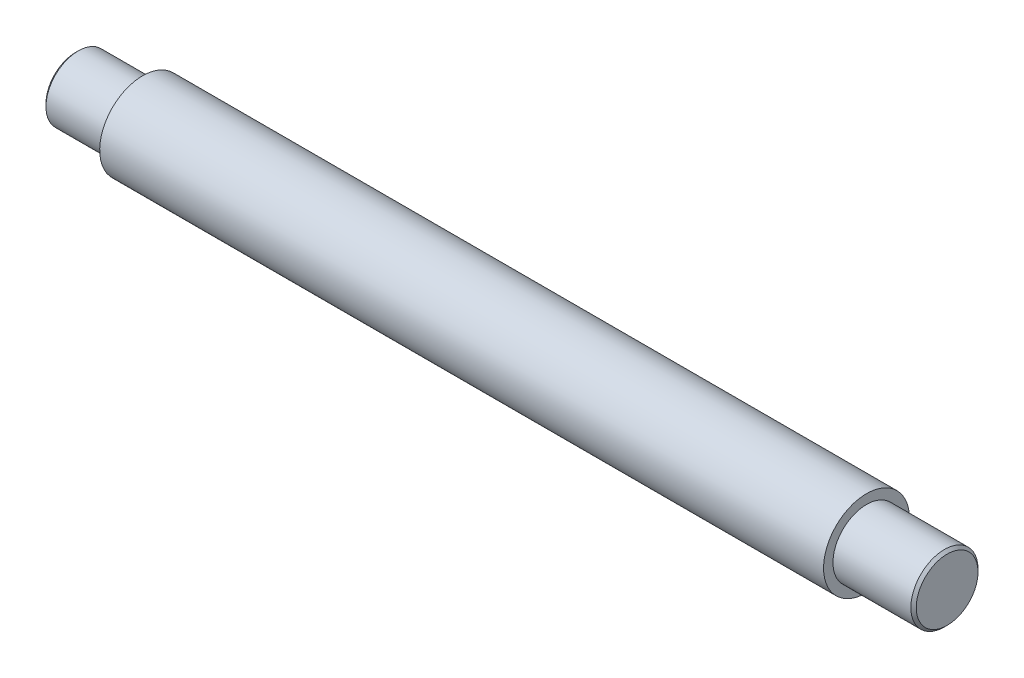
ISO-10303-21;
HEADER;
FILE_DESCRIPTION(('STEP AP214'),'2;1');
FILE_NAME('part.step','',(''),(''),'','','');
FILE_SCHEMA(('AUTOMOTIVE_DESIGN { 1 0 10303 214 1 1 1 1 }'));
ENDSEC;
DATA;
#1=APPLICATION_CONTEXT('core data for automotive mechanical design processes');
#2=APPLICATION_PROTOCOL_DEFINITION('international standard','automotive_design',2000,#1);
#3=PRODUCT_CONTEXT('',#1,'mechanical');
#4=PRODUCT('Part','Part','',(#3));
#5=PRODUCT_RELATED_PRODUCT_CATEGORY('part','',(#4));
#6=PRODUCT_DEFINITION_FORMATION('','',#4);
#7=PRODUCT_DEFINITION_CONTEXT('part definition',#1,'design');
#8=PRODUCT_DEFINITION('design','',#6,#7);
#9=PRODUCT_DEFINITION_SHAPE('','',#8);
#10=(LENGTH_UNIT() NAMED_UNIT(*) SI_UNIT(.MILLI.,.METRE.));
#11=(NAMED_UNIT(*) PLANE_ANGLE_UNIT() SI_UNIT($,.RADIAN.));
#12=(NAMED_UNIT(*) SI_UNIT($,.STERADIAN.) SOLID_ANGLE_UNIT());
#13=UNCERTAINTY_MEASURE_WITH_UNIT(LENGTH_MEASURE(1.E-05),#10,'distance_accuracy_value','');
#14=(GEOMETRIC_REPRESENTATION_CONTEXT(3) GLOBAL_UNCERTAINTY_ASSIGNED_CONTEXT((#13)) GLOBAL_UNIT_ASSIGNED_CONTEXT((#10,
#11,#12)) REPRESENTATION_CONTEXT('',''));
#15=CARTESIAN_POINT('',(0.,0.,0.));
#16=DIRECTION('',(0.,0.,1.));
#17=DIRECTION('',(1.,0.,0.));
#18=AXIS2_PLACEMENT_3D('',#15,#16,#17);
#19=CARTESIAN_POINT('',(311.461782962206,436.896737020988,97.0115114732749));
#20=DIRECTION('',(-1.,0.,0.));
#21=DIRECTION('',(0.,-1.,0.));
#22=AXIS2_PLACEMENT_3D('',#19,#20,#21);
#23=PLANE('',#22);
#24=CARTESIAN_POINT('',(311.461782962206,433.486383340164,86.0288211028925));
#25=DIRECTION('',(-1.,0.,0.));
#26=DIRECTION('',(0.,-1.,0.));
#27=AXIS2_PLACEMENT_3D('',#24,#25,#26);
#28=CIRCLE('',#27,11.5);
#29=CARTESIAN_POINT('',(311.461782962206,421.986383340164,86.0288211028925));
#30=VERTEX_POINT('',#29);
#31=EDGE_CURVE('E204',#30,#30,#28,.T.);
#32=ORIENTED_EDGE('',*,*,#31,.F.);
#33=EDGE_LOOP('',(#32));
#34=FACE_BOUND('',#33,.T.);
#35=ADVANCED_FACE('F32',(#34),#23,.F.);
#36=CARTESIAN_POINT('',(311.461782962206,433.486383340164,86.0288211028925));
#37=DIRECTION('',(-1.,0.,0.));
#38=DIRECTION('',(0.,-1.,0.));
#39=AXIS2_PLACEMENT_3D('',#36,#37,#38);
#40=CONICAL_SURFACE('',#39,11.5,0.785398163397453);
#41=CARTESIAN_POINT('',(310.461782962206,433.486383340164,86.0288211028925));
#42=DIRECTION('',(-1.,0.,0.));
#43=DIRECTION('',(0.,-1.,0.));
#44=AXIS2_PLACEMENT_3D('',#41,#42,#43);
#45=CIRCLE('',#44,12.5);
#46=CARTESIAN_POINT('',(310.461782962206,420.986383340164,86.0288211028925));
#47=VERTEX_POINT('',#46);
#48=EDGE_CURVE('E201',#47,#47,#45,.T.);
#49=ORIENTED_EDGE('',*,*,#48,.F.);
#50=EDGE_LOOP('',(#49));
#51=FACE_BOUND('',#50,.T.);
#52=ORIENTED_EDGE('',*,*,#31,.T.);
#53=EDGE_LOOP('',(#52));
#54=FACE_BOUND('',#53,.T.);
#55=ADVANCED_FACE('F323',(#51,#54),#40,.T.);
#56=CARTESIAN_POINT('',(-27.883598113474,433.486383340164,86.0288211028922));
#57=DIRECTION('',(-1.,0.,0.));
#58=DIRECTION('',(0.,-1.,0.));
#59=AXIS2_PLACEMENT_3D('',#56,#57,#58);
#60=CYLINDRICAL_SURFACE('',#59,12.5);
#61=DIRECTION('',(-1.,0.,0.));
#62=VECTOR('',#61,1.);
#63=CARTESIAN_POINT('',(-27.883598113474,436.216039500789,73.8305024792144));
#64=LINE('',#63,#62);
#65=CARTESIAN_POINT('',(287.461782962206,436.216039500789,73.8305024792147));
#66=VERTEX_POINT('',#65);
#67=CARTESIAN_POINT('',(305.461782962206,436.216039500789,73.8305024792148));
#68=VERTEX_POINT('',#67);
#69=EDGE_CURVE('E291',#66,#68,#64,.F.);
#70=ORIENTED_EDGE('',*,*,#69,.T.);
#71=CARTESIAN_POINT('',(305.461782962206,436.216039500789,73.8305024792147));
#72=CARTESIAN_POINT('',(305.544859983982,436.216027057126,73.8305061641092));
#73=CARTESIAN_POINT('',(305.627931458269,436.219508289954,73.831278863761));
#74=CARTESIAN_POINT('',(305.793455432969,436.233362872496,73.8343881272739));
#75=CARTESIAN_POINT('',(305.875908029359,436.243735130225,73.8367244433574));
#76=CARTESIAN_POINT('',(306.03945947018,436.271250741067,73.8429808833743));
#77=CARTESIAN_POINT('',(306.120560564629,436.288381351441,73.8468980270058));
#78=CARTESIAN_POINT('',(306.280971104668,436.329215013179,73.8563626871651));
#79=CARTESIAN_POINT('',(306.360280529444,436.352918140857,73.8619102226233));
#80=CARTESIAN_POINT('',(306.594684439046,436.433554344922,73.881093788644));
#81=CARTESIAN_POINT('',(306.746411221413,436.500041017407,73.8972764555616));
#82=CARTESIAN_POINT('',(307.036478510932,436.65587803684,73.9370582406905));
#83=CARTESIAN_POINT('',(307.174815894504,436.745233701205,73.9606590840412));
#84=CARTESIAN_POINT('',(307.43704018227,436.945515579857,74.0165198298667));
#85=CARTESIAN_POINT('',(307.56061952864,437.056803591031,74.0489290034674));
#86=CARTESIAN_POINT('',(307.787092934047,437.296157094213,74.1228860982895));
#87=CARTESIAN_POINT('',(307.889983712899,437.424225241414,74.1644354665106));
#88=CARTESIAN_POINT('',(308.07341122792,437.694774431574,74.2576637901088));
#89=CARTESIAN_POINT('',(308.153645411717,437.837418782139,74.3094654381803));
#90=CARTESIAN_POINT('',(308.287512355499,438.131100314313,74.4227306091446));
#91=CARTESIAN_POINT('',(308.341150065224,438.282135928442,74.484192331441));
#92=CARTESIAN_POINT('',(308.419320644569,438.584874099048,74.61470516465));
#93=CARTESIAN_POINT('',(308.444379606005,438.736511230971,74.6835926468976));
#94=CARTESIAN_POINT('',(308.466330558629,439.038509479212,74.8282892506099));
#95=CARTESIAN_POINT('',(308.463225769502,439.188870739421,74.9040975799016));
#96=CARTESIAN_POINT('',(308.429319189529,439.480850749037,75.0587203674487));
#97=CARTESIAN_POINT('',(308.399085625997,439.622585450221,75.1374415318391));
#98=CARTESIAN_POINT('',(308.312690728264,439.896883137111,75.2965961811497));
#99=CARTESIAN_POINT('',(308.256528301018,440.029445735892,75.3770297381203));
#100=CARTESIAN_POINT('',(308.11939530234,440.283389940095,75.5372314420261));
#101=CARTESIAN_POINT('',(308.03821781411,440.404666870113,75.6169881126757));
#102=CARTESIAN_POINT('',(307.853516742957,440.632254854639,75.7718480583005));
#103=CARTESIAN_POINT('',(307.749990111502,440.738563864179,75.8469506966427));
#104=CARTESIAN_POINT('',(307.520481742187,440.936674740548,75.9909652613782));
#105=CARTESIAN_POINT('',(307.394005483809,441.028049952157,76.0596767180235));
#106=CARTESIAN_POINT('',(307.123738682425,441.191330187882,76.1853236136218));
#107=CARTESIAN_POINT('',(306.979943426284,441.263229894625,76.2422558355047));
#108=CARTESIAN_POINT('',(306.678227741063,441.386461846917,76.3414545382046));
#109=CARTESIAN_POINT('',(306.520244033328,441.437695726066,76.3836507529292));
#110=CARTESIAN_POINT('',(306.19529881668,441.517998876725,76.4504117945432));
#111=CARTESIAN_POINT('',(306.028351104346,441.547101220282,76.4750029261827));
#112=CARTESIAN_POINT('',(305.793614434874,441.57178276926,76.4959112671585));
#113=CARTESIAN_POINT('',(305.72737602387,441.576983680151,76.500326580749));
#114=CARTESIAN_POINT('',(305.594696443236,441.583910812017,76.5062128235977));
#115=CARTESIAN_POINT('',(305.528255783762,441.585642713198,76.5076885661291));
#116=CARTESIAN_POINT('',(305.461782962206,441.585645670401,76.5076893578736));
#117=B_SPLINE_CURVE_WITH_KNOTS('',3,(#71,#72,#73,#74,#75,#76,#77,#78,#79,#80,#81,#82,#83,#84,
#85,#86,#87,#88,#89,#90,#91,#92,#93,#94,#95,#96,#97,#98,#99,#100,#101,#102,#103,#104,#105,#106,
#107,#108,#109,#110,#111,#112,#113,#114,#115,#116),.UNSPECIFIED.,.F.,.F.,(4,2,2,2,2,2,2,2,2,2,2,
2,2,2,2,2,2,2,2,2,2,2,4),(0.,0.24914497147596,0.498250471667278,0.746888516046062,
0.995529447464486,1.49234020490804,1.9892665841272,2.49520478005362,3.00122312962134,
3.51370966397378,4.02610078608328,4.52889907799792,5.03163989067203,5.5240901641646,
6.01656119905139,6.51322041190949,7.00994741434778,7.51903074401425,8.028252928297,
8.5398711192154,9.05072326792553,9.25036600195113,9.44968157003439),.UNSPECIFIED.);
#118=CARTESIAN_POINT('',(305.461782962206,441.585645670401,76.5076893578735));
#119=VERTEX_POINT('',#118);
#120=EDGE_CURVE('E308',#68,#119,#117,.T.);
#121=ORIENTED_EDGE('',*,*,#120,.T.);
#122=DIRECTION('',(-1.,0.,0.));
#123=VECTOR('',#122,1.);
#124=CARTESIAN_POINT('',(-27.883598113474,441.585645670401,76.5076893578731));
#125=LINE('',#124,#123);
#126=CARTESIAN_POINT('',(287.461782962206,441.585645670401,76.5076893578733));
#127=VERTEX_POINT('',#126);
#128=EDGE_CURVE('E124',#119,#127,#125,.T.);
#129=ORIENTED_EDGE('',*,*,#128,.T.);
#130=CARTESIAN_POINT('',(287.461782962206,441.585645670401,76.5076893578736));
#131=CARTESIAN_POINT('',(287.37870594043,441.585650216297,76.5077015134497));
#132=CARTESIAN_POINT('',(287.295634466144,441.582938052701,76.5053862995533));
#133=CARTESIAN_POINT('',(287.130110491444,441.572116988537,76.4961927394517));
#134=CARTESIAN_POINT('',(287.047657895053,441.564008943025,76.4893151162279));
#135=CARTESIAN_POINT('',(286.884106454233,441.542453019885,76.4711053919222));
#136=CARTESIAN_POINT('',(286.803005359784,441.529015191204,76.459781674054));
#137=CARTESIAN_POINT('',(286.642594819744,441.496882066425,76.4328664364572));
#138=CARTESIAN_POINT('',(286.563285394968,441.478186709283,76.417274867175));
#139=CARTESIAN_POINT('',(286.328881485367,441.414337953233,76.3644208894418));
#140=CARTESIAN_POINT('',(286.177154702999,441.361401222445,76.3210612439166));
#141=CARTESIAN_POINT('',(285.887087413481,441.23584501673,76.2205455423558));
#142=CARTESIAN_POINT('',(285.748750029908,441.163220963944,76.1633862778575));
#143=CARTESIAN_POINT('',(285.486525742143,440.998075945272,76.037051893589));
#144=CARTESIAN_POINT('',(285.362946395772,440.905218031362,75.967677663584));
#145=CARTESIAN_POINT('',(285.136472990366,440.702106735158,75.8210299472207));
#146=CARTESIAN_POINT('',(285.033582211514,440.591850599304,75.743755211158));
#147=CARTESIAN_POINT('',(284.850154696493,440.354574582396,75.5837912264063));
#148=CARTESIAN_POINT('',(284.769920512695,440.22735843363,75.5010453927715));
#149=CARTESIAN_POINT('',(284.636053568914,439.960158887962,75.3346655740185));
#150=CARTESIAN_POINT('',(284.582415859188,439.820177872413,75.2510317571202));
#151=CARTESIAN_POINT('',(284.504245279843,439.533753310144,75.0877988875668));
#152=CARTESIAN_POINT('',(284.479186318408,439.387479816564,75.0081536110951));
#153=CARTESIAN_POINT('',(284.457235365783,439.090172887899,74.8540476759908));
#154=CARTESIAN_POINT('',(284.460340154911,438.939139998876,74.7795864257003));
#155=CARTESIAN_POINT('',(284.494246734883,438.639934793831,74.6394551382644));
#156=CARTESIAN_POINT('',(284.524480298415,438.491767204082,74.5736363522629));
#157=CARTESIAN_POINT('',(284.610875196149,438.199584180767,74.4503541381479));
#158=CARTESIAN_POINT('',(284.667037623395,438.055568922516,74.392891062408));
#159=CARTESIAN_POINT('',(284.804170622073,437.774798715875,74.2864939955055));
#160=CARTESIAN_POINT('',(284.885348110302,437.638115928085,74.2376366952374));
#161=CARTESIAN_POINT('',(285.070049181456,437.377473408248,74.1490738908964));
#162=CARTESIAN_POINT('',(285.173575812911,437.253515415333,74.1093696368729));
#163=CARTESIAN_POINT('',(285.403084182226,437.019274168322,74.0378213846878));
#164=CARTESIAN_POINT('',(285.529560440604,436.909407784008,74.0061974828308));
#165=CARTESIAN_POINT('',(285.799827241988,436.710797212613,73.9514122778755));
#166=CARTESIAN_POINT('',(285.943622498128,436.622058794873,73.9282532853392));
#167=CARTESIAN_POINT('',(286.245338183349,436.468672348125,73.8895351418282));
#168=CARTESIAN_POINT('',(286.403321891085,436.40413963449,73.8740122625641));
#169=CARTESIAN_POINT('',(286.728267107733,436.302494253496,73.8500571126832));
#170=CARTESIAN_POINT('',(286.895214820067,436.265340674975,73.8416142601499));
#171=CARTESIAN_POINT('',(287.129951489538,436.233788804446,73.8344856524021));
#172=CARTESIAN_POINT('',(287.196189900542,436.227132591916,73.8329892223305));
#173=CARTESIAN_POINT('',(287.328869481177,436.218262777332,73.8309993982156));
#174=CARTESIAN_POINT('',(287.39531014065,436.216041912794,73.8305043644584));
#175=CARTESIAN_POINT('',(287.461782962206,436.216039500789,73.8305024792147));
#176=B_SPLINE_CURVE_WITH_KNOTS('',3,(#130,#131,#132,#133,#134,#135,#136,#137,#138,#139,#140,
#141,#142,#143,#144,#145,#146,#147,#148,#149,#150,#151,#152,#153,#154,#155,#156,#157,#158,#159,
#160,#161,#162,#163,#164,#165,#166,#167,#168,#169,#170,#171,#172,#173,#174,#175),.UNSPECIFIED.,
.F.,.F.,(4,2,2,2,2,2,2,2,2,2,2,2,2,2,2,2,2,2,2,2,2,2,4),(0.,0.249144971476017,0.498250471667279,
0.746888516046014,0.995529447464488,1.49234020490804,1.98926658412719,2.49520478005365,
3.0012231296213,3.51370966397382,4.02610078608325,4.52889907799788,5.03163989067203,
5.52409016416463,6.0165611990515,6.51322041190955,7.00994741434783,7.51903074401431,
8.02825292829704,8.53987111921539,9.05072326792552,9.25036600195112,9.44968157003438),.UNSPECIFIED.);
#177=EDGE_CURVE('E283',#127,#66,#176,.T.);
#178=ORIENTED_EDGE('',*,*,#177,.T.);
#179=EDGE_LOOP('',(#70,#121,#129,#178));
#180=FACE_BOUND('',#179,.T.);
#181=CARTESIAN_POINT('',(281.461782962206,433.486383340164,86.0288211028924));
#182=DIRECTION('',(-1.,0.,0.));
#183=DIRECTION('',(0.,-1.,0.));
#184=AXIS2_PLACEMENT_3D('',#181,#182,#183);
#185=CIRCLE('',#184,12.5);
#186=CARTESIAN_POINT('',(281.461782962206,420.986383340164,86.0288211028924));
#187=VERTEX_POINT('',#186);
#188=EDGE_CURVE('E198',#187,#187,#185,.T.);
#189=ORIENTED_EDGE('',*,*,#188,.F.);
#190=EDGE_LOOP('',(#189));
#191=FACE_BOUND('',#190,.T.);
#192=ORIENTED_EDGE('',*,*,#48,.T.);
#193=EDGE_LOOP('',(#192));
#194=FACE_BOUND('',#193,.T.);
#195=ADVANCED_FACE('F293',(#180,#191,#194),#60,.T.);
#196=CARTESIAN_POINT('',(281.461782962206,438.231223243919,101.309085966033));
#197=DIRECTION('',(-1.,0.,0.));
#198=DIRECTION('',(0.,-1.,0.));
#199=AXIS2_PLACEMENT_3D('',#196,#197,#198);
#200=PLANE('',#199);
#201=CARTESIAN_POINT('',(281.461782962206,433.486383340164,86.0288211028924));
#202=DIRECTION('',(-1.,0.,0.));
#203=DIRECTION('',(0.,-1.,0.));
#204=AXIS2_PLACEMENT_3D('',#201,#202,#203);
#205=CIRCLE('',#204,16.);
#206=CARTESIAN_POINT('',(281.461782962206,417.486383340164,86.0288211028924));
#207=VERTEX_POINT('',#206);
#208=EDGE_CURVE('E195',#207,#207,#205,.T.);
#209=ORIENTED_EDGE('',*,*,#208,.F.);
#210=EDGE_LOOP('',(#209));
#211=FACE_BOUND('',#210,.T.);
#212=ORIENTED_EDGE('',*,*,#188,.T.);
#213=EDGE_LOOP('',(#212));
#214=FACE_BOUND('',#213,.T.);
#215=ADVANCED_FACE('F334',(#211,#214),#200,.F.);
#216=CARTESIAN_POINT('',(-27.883598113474,433.486383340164,86.0288211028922));
#217=DIRECTION('',(-1.,0.,0.));
#218=DIRECTION('',(0.,-1.,0.));
#219=AXIS2_PLACEMENT_3D('',#216,#217,#218);
#220=CYLINDRICAL_SURFACE('',#219,16.);
#221=DIRECTION('',(-1.,0.,0.));
#222=VECTOR('',#221,1.);
#223=CARTESIAN_POINT('',(-27.883598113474,417.994449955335,90.0288211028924));
#224=LINE('',#223,#222);
#225=CARTESIAN_POINT('',(39.9617829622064,417.994449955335,90.0288211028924));
#226=VERTEX_POINT('',#225);
#227=CARTESIAN_POINT('',(51.9617829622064,417.994449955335,90.0288211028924));
#228=VERTEX_POINT('',#227);
#229=EDGE_CURVE('E259',#226,#228,#224,.F.);
#230=ORIENTED_EDGE('',*,*,#229,.T.);
#231=CARTESIAN_POINT('',(55.9617829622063,417.486383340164,86.0288211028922));
#232=CARTESIAN_POINT('',(55.9617767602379,417.486387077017,85.807818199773));
#233=CARTESIAN_POINT('',(55.9434054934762,417.491007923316,85.5867460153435));
#234=CARTESIAN_POINT('',(55.8705158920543,417.508993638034,85.1509375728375));
#235=CARTESIAN_POINT('',(55.8159770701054,417.522363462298,84.9362049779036));
#236=CARTESIAN_POINT('',(55.6726116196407,417.556366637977,84.5194321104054));
#237=CARTESIAN_POINT('',(55.5838261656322,417.576991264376,84.3173769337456));
#238=CARTESIAN_POINT('',(55.3746325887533,417.623307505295,83.9310287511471));
#239=CARTESIAN_POINT('',(55.2542233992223,417.64899929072,83.7467363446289));
#240=CARTESIAN_POINT('',(54.9825808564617,417.703252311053,83.3973492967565));
#241=CARTESIAN_POINT('',(54.8308187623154,417.731857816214,83.2326725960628));
#242=CARTESIAN_POINT('',(54.5019104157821,417.788420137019,82.9308239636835));
#243=CARTESIAN_POINT('',(54.3247613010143,417.816376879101,82.7936551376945));
#244=CARTESIAN_POINT('',(53.9468623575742,417.86892265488,82.5487503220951));
#245=CARTESIAN_POINT('',(53.7458010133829,417.893455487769,82.4414818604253));
#246=CARTESIAN_POINT('',(53.3277871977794,417.935730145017,82.2624293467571));
#247=CARTESIAN_POINT('',(53.1108372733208,417.95347305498,82.1906396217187));
#248=CARTESIAN_POINT('',(52.671800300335,417.979703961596,82.0860082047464));
#249=CARTESIAN_POINT('',(52.4499032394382,417.988370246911,82.052415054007));
#250=CARTESIAN_POINT('',(52.0034667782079,417.996000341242,82.0227897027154));
#251=CARTESIAN_POINT('',(51.7789278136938,417.994965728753,82.0267513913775));
#252=CARTESIAN_POINT('',(51.3393408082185,417.983471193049,82.0715237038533));
#253=CARTESIAN_POINT('',(51.1241946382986,417.973240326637,82.1114388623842));
#254=CARTESIAN_POINT('',(50.70375349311,417.944871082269,82.2255566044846));
#255=CARTESIAN_POINT('',(50.4984592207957,417.926732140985,82.2997616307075));
#256=CARTESIAN_POINT('',(50.1011482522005,417.88438030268,82.4811158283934));
#257=CARTESIAN_POINT('',(49.9092865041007,417.860107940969,82.5885899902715));
#258=CARTESIAN_POINT('',(49.545999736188,417.808257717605,82.8332043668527));
#259=CARTESIAN_POINT('',(49.3745783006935,417.780679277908,82.9703497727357));
#260=CARTESIAN_POINT('',(49.0519066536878,417.724359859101,83.2750519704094));
#261=CARTESIAN_POINT('',(48.9013709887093,417.695608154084,83.4433644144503));
#262=CARTESIAN_POINT('',(48.6305263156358,417.640890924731,83.8031893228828));
#263=CARTESIAN_POINT('',(48.5102182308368,417.614925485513,83.9947024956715));
#264=CARTESIAN_POINT('',(48.3029813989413,417.568577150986,84.396512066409));
#265=CARTESIAN_POINT('',(48.2161687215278,417.548213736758,84.606870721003));
#266=CARTESIAN_POINT('',(48.0793368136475,417.515505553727,85.0398184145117));
#267=CARTESIAN_POINT('',(48.0293105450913,417.503159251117,85.2624051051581));
#268=CARTESIAN_POINT('',(47.9685627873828,417.488103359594,85.7073811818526));
#269=CARTESIAN_POINT('',(47.9568682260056,417.48515524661,85.9296298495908));
#270=CARTESIAN_POINT('',(47.9704469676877,417.488548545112,86.37290876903));
#271=CARTESIAN_POINT('',(47.9957169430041,417.494889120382,86.5939391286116));
#272=CARTESIAN_POINT('',(48.0817053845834,417.515994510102,87.02512581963));
#273=CARTESIAN_POINT('',(48.141892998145,417.53063309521,87.235394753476));
#274=CARTESIAN_POINT('',(48.295401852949,417.566684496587,87.6428405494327));
#275=CARTESIAN_POINT('',(48.3887264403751,417.588097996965,87.8400160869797));
#276=CARTESIAN_POINT('',(48.607745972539,417.635895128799,88.2195494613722));
#277=CARTESIAN_POINT('',(48.7339859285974,417.662360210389,88.4015822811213));
#278=CARTESIAN_POINT('',(49.0145560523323,417.717196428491,88.7422254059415));
#279=CARTESIAN_POINT('',(49.1688910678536,417.745567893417,88.9008316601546));
#280=CARTESIAN_POINT('',(49.5057881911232,417.801877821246,89.1941292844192));
#281=CARTESIAN_POINT('',(49.6889501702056,417.829788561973,89.3281380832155));
#282=CARTESIAN_POINT('',(50.0757366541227,417.881239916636,89.5635164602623));
#283=CARTESIAN_POINT('',(50.2793602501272,417.904780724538,89.6648874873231));
#284=CARTESIAN_POINT('',(50.7001982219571,417.944567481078,89.8313582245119));
#285=CARTESIAN_POINT('',(50.9173233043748,417.960856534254,89.8966728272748));
#286=CARTESIAN_POINT('',(51.3599419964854,417.984336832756,89.9897428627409));
#287=CARTESIAN_POINT('',(51.5854337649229,417.991530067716,90.0175065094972));
#288=CARTESIAN_POINT('',(52.0314390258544,417.995852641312,90.0342573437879));
#289=CARTESIAN_POINT('',(52.2519094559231,417.993265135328,90.0243354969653));
#290=CARTESIAN_POINT('',(52.6879266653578,417.978972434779,89.9684938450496));
#291=CARTESIAN_POINT('',(52.9034735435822,417.967267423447,89.9225747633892));
#292=CARTESIAN_POINT('',(53.3223388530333,417.936216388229,89.7966379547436));
#293=CARTESIAN_POINT('',(53.5257224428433,417.91691626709,89.7168248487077));
#294=CARTESIAN_POINT('',(53.9163573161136,417.872843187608,89.5255275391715));
#295=CARTESIAN_POINT('',(54.1036063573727,417.848069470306,89.4140389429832));
#296=CARTESIAN_POINT('',(54.4619286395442,417.795033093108,89.1591350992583));
#297=CARTESIAN_POINT('',(54.6324524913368,417.766696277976,89.0149628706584));
#298=CARTESIAN_POINT('',(54.9472417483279,417.710169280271,88.7002594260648));
#299=CARTESIAN_POINT('',(55.0915009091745,417.681979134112,88.5297219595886));
#300=CARTESIAN_POINT('',(55.3522131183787,417.628312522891,88.1634013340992));
#301=CARTESIAN_POINT('',(55.4681152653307,417.602894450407,87.9672168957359));
#302=CARTESIAN_POINT('',(55.6651095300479,417.558252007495,87.5575305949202));
#303=CARTESIAN_POINT('',(55.7462265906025,417.539023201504,87.3440412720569));
#304=CARTESIAN_POINT('',(55.8593078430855,417.511768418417,86.9472484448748));
#305=CARTESIAN_POINT('',(55.8976529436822,417.502314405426,86.7658348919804));
#306=CARTESIAN_POINT('',(55.9488921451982,417.489620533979,86.3992372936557));
#307=CARTESIAN_POINT('',(55.9617881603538,417.486380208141,86.2140535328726));
#308=CARTESIAN_POINT('',(55.9617829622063,417.486383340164,86.0288211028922));
#309=B_SPLINE_CURVE_WITH_KNOTS('',3,(#231,#232,#233,#234,#235,#236,#237,#238,#239,#240,#241,
#242,#243,#244,#245,#246,#247,#248,#249,#250,#251,#252,#253,#254,#255,#256,#257,#258,#259,#260,
#261,#262,#263,#264,#265,#266,#267,#268,#269,#270,#271,#272,#273,#274,#275,#276,#277,#278,#279,
#280,#281,#282,#283,#284,#285,#286,#287,#288,#289,#290,#291,#292,#293,#294,#295,#296,#297,#298,
#299,#300,#301,#302,#303,#304,#305,#306,#307,#308),.UNSPECIFIED.,.T.,.F.,(4,2,2,2,2,2,2,2,2,2,2,
2,2,2,2,2,2,2,2,2,2,2,2,2,2,2,2,2,2,2,2,2,2,2,2,2,2,2,4),(0.,0.662329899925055,1.32503530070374,
1.98694640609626,2.64887984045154,3.32305161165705,3.99729945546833,4.68156393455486,
5.3657189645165,6.03616786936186,6.7065076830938,7.3605999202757,8.0147387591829,
8.67548074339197,9.33633842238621,10.016040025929,10.6957623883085,11.3778194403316,
12.059745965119,12.7242215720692,13.388637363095,14.0432073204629,14.6978433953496,
15.3640956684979,16.0304630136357,16.7131869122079,17.3958805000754,18.0744601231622,
18.7528912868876,19.4118341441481,20.0707637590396,20.7257706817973,21.3808684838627,
22.0530553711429,22.7254018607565,23.4099249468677,24.0939563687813,24.6491264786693,
25.2042548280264),.UNSPECIFIED.);
#310=CARTESIAN_POINT('',(51.9617829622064,417.994449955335,82.0288211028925));
#311=VERTEX_POINT('',#310);
#312=EDGE_CURVE('E277',#228,#311,#309,.T.);
#313=ORIENTED_EDGE('',*,*,#312,.T.);
#314=DIRECTION('',(-1.,0.,0.));
#315=VECTOR('',#314,1.);
#316=CARTESIAN_POINT('',(-27.883598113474,417.994449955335,82.0288211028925));
#317=LINE('',#316,#315);
#318=CARTESIAN_POINT('',(39.9617829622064,417.994449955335,82.0288211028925));
#319=VERTEX_POINT('',#318);
#320=EDGE_CURVE('E249',#311,#319,#317,.T.);
#321=ORIENTED_EDGE('',*,*,#320,.T.);
#322=CARTESIAN_POINT('',(39.9617829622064,417.994449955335,82.0288211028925));
#323=CARTESIAN_POINT('',(39.8511625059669,417.99446231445,82.0288082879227));
#324=CARTESIAN_POINT('',(39.7405496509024,417.993265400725,82.0334097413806));
#325=CARTESIAN_POINT('',(39.5201510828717,417.988544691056,82.0517416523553));
#326=CARTESIAN_POINT('',(39.4103652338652,417.985021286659,82.0654705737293));
#327=CARTESIAN_POINT('',(39.1926101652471,417.975748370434,82.1019219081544));
#328=CARTESIAN_POINT('',(39.0846377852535,417.970003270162,82.124626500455));
#329=CARTESIAN_POINT('',(38.87108086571,417.956468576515,82.178818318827));
#330=CARTESIAN_POINT('',(38.7654963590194,417.948678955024,82.2103056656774));
#331=CARTESIAN_POINT('',(38.4534468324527,417.922569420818,82.3175963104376));
#332=CARTESIAN_POINT('',(38.251467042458,417.901498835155,82.4062651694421));
#333=CARTESIAN_POINT('',(37.8652935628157,417.854417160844,82.6151683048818));
#334=CARTESIAN_POINT('',(37.6811046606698,417.828404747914,82.7354110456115));
#335=CARTESIAN_POINT('',(37.3316194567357,417.77373306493,83.0068808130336));
#336=CARTESIAN_POINT('',(37.1667666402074,417.745031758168,83.1586713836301));
#337=CARTESIAN_POINT('',(36.8645713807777,417.688579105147,83.4877186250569));
#338=CARTESIAN_POINT('',(36.7272333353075,417.660827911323,83.6649793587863));
#339=CARTESIAN_POINT('',(36.4821398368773,417.608936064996,84.0429933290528));
#340=CARTESIAN_POINT('',(36.3748236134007,417.584851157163,84.2440396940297));
#341=CARTESIAN_POINT('',(36.1956837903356,417.543489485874,84.6620107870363));
#342=CARTESIAN_POINT('',(36.1238532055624,417.526211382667,84.8789323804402));
#343=CARTESIAN_POINT('',(36.0191470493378,417.50070734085,85.317844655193));
#344=CARTESIAN_POINT('',(35.9855122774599,417.492305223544,85.5396438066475));
#345=CARTESIAN_POINT('',(35.955769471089,417.4848858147,85.9858900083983));
#346=CARTESIAN_POINT('',(35.959656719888,417.485867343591,86.21033672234));
#347=CARTESIAN_POINT('',(36.0043027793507,417.496973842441,86.6502310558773));
#348=CARTESIAN_POINT('',(36.044241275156,417.506895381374,86.8657678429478));
#349=CARTESIAN_POINT('',(36.1585378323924,417.534530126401,87.2869760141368));
#350=CARTESIAN_POINT('',(36.2328974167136,417.552243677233,87.4926469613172));
#351=CARTESIAN_POINT('',(36.4145875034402,417.593783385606,87.8904499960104));
#352=CARTESIAN_POINT('',(36.5222103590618,417.617663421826,88.0824426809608));
#353=CARTESIAN_POINT('',(36.7671576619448,417.668945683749,88.4459285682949));
#354=CARTESIAN_POINT('',(36.9044865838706,417.69634843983,88.6174186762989));
#355=CARTESIAN_POINT('',(37.2092902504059,417.752560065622,88.9398950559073));
#356=CARTESIAN_POINT('',(37.3774779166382,417.781386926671,89.0902038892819));
#357=CARTESIAN_POINT('',(37.737134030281,417.836539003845,89.3607130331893));
#358=CARTESIAN_POINT('',(37.9286088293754,417.862863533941,89.4809051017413));
#359=CARTESIAN_POINT('',(38.2296813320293,417.898243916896,89.6361374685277));
#360=CARTESIAN_POINT('',(38.3327039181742,417.909382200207,89.6838185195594));
#361=CARTESIAN_POINT('',(38.5425639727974,417.929927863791,89.7703011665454));
#362=CARTESIAN_POINT('',(38.6493998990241,417.939335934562,89.8091063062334));
#363=CARTESIAN_POINT('',(38.8660121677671,417.956120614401,89.877480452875));
#364=CARTESIAN_POINT('',(38.9757853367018,417.963499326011,89.9070590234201));
#365=CARTESIAN_POINT('',(39.1975314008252,417.976005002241,89.9567748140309));
#366=CARTESIAN_POINT('',(39.3095032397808,417.981133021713,89.9769164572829));
#367=CARTESIAN_POINT('',(39.511589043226,417.988167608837,90.0044307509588));
#368=CARTESIAN_POINT('',(39.6014500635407,417.990520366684,90.0135798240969));
#369=CARTESIAN_POINT('',(39.7814658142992,417.993662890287,90.0257725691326));
#370=CARTESIAN_POINT('',(39.8716198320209,417.994455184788,90.0288261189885));
#371=CARTESIAN_POINT('',(39.9617829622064,417.994449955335,90.0288211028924));
#372=B_SPLINE_CURVE_WITH_KNOTS('',3,(#322,#323,#324,#325,#326,#327,#328,#329,#330,#331,#332,
#333,#334,#335,#336,#337,#338,#339,#340,#341,#342,#343,#344,#345,#346,#347,#348,#349,#350,#351,
#352,#353,#354,#355,#356,#357,#358,#359,#360,#361,#362,#363,#364,#365,#366,#367,#368,#369,#370,
#371),.UNSPECIFIED.,.F.,.F.,(4,2,2,2,2,2,2,2,2,2,2,2,2,2,2,2,2,2,2,2,2,2,2,2,4),(0.,
0.331746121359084,0.663436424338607,0.994471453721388,1.32551103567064,1.98693231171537,
2.64853108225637,3.32315877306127,3.99789419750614,4.68203866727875,5.36604841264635,
6.03621044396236,6.70628823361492,7.3614930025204,8.01672676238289,8.67789156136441,
9.33915602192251,10.018248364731,10.6975263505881,11.0393784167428,11.38109375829,
11.7224537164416,12.0636535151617,12.3345095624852,12.6049263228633),.UNSPECIFIED.);
#373=EDGE_CURVE('E252',#319,#226,#372,.T.);
#374=ORIENTED_EDGE('',*,*,#373,.T.);
#375=EDGE_LOOP('',(#230,#313,#321,#374));
#376=FACE_BOUND('',#375,.T.);
#377=DIRECTION('',(-1.,0.,0.));
#378=VECTOR('',#377,1.);
#379=CARTESIAN_POINT('',(-27.883598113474,417.994449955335,90.0288211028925));
#380=LINE('',#379,#378);
#381=CARTESIAN_POINT('',(195.961782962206,417.994449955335,90.0288211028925));
#382=VERTEX_POINT('',#381);
#383=CARTESIAN_POINT('',(207.961782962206,417.994449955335,90.0288211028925));
#384=VERTEX_POINT('',#383);
#385=EDGE_CURVE('E218',#382,#384,#380,.F.);
#386=ORIENTED_EDGE('',*,*,#385,.T.);
#387=CARTESIAN_POINT('',(211.961782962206,417.486383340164,86.0288211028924));
#388=CARTESIAN_POINT('',(211.961776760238,417.486387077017,85.8078181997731));
#389=CARTESIAN_POINT('',(211.943405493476,417.491007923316,85.5867460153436));
#390=CARTESIAN_POINT('',(211.870515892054,417.508993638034,85.1509375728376));
#391=CARTESIAN_POINT('',(211.815977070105,417.522363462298,84.9362049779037));
#392=CARTESIAN_POINT('',(211.672611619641,417.556366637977,84.5194321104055));
#393=CARTESIAN_POINT('',(211.583826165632,417.576991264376,84.3173769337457));
#394=CARTESIAN_POINT('',(211.374632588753,417.623307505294,83.9310287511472));
#395=CARTESIAN_POINT('',(211.254223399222,417.64899929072,83.746736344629));
#396=CARTESIAN_POINT('',(210.982580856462,417.703252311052,83.3973492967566));
#397=CARTESIAN_POINT('',(210.830818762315,417.731857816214,83.2326725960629));
#398=CARTESIAN_POINT('',(210.501910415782,417.788420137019,82.9308239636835));
#399=CARTESIAN_POINT('',(210.324761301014,417.816376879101,82.7936551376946));
#400=CARTESIAN_POINT('',(209.946862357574,417.86892265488,82.5487503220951));
#401=CARTESIAN_POINT('',(209.745801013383,417.893455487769,82.4414818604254));
#402=CARTESIAN_POINT('',(209.32778719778,417.935730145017,82.2624293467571));
#403=CARTESIAN_POINT('',(209.110837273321,417.95347305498,82.1906396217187));
#404=CARTESIAN_POINT('',(208.671800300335,417.979703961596,82.0860082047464));
#405=CARTESIAN_POINT('',(208.449903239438,417.988370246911,82.052415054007));
#406=CARTESIAN_POINT('',(208.003466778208,417.996000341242,82.0227897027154));
#407=CARTESIAN_POINT('',(207.778927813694,417.994965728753,82.0267513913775));
#408=CARTESIAN_POINT('',(207.339340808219,417.983471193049,82.0715237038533));
#409=CARTESIAN_POINT('',(207.124194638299,417.973240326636,82.1114388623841));
#410=CARTESIAN_POINT('',(206.70375349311,417.944871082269,82.2255566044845));
#411=CARTESIAN_POINT('',(206.498459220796,417.926732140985,82.2997616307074));
#412=CARTESIAN_POINT('',(206.101148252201,417.88438030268,82.4811158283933));
#413=CARTESIAN_POINT('',(205.909286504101,417.860107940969,82.5885899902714));
#414=CARTESIAN_POINT('',(205.545999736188,417.808257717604,82.8332043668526));
#415=CARTESIAN_POINT('',(205.374578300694,417.780679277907,82.9703497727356));
#416=CARTESIAN_POINT('',(205.051906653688,417.724359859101,83.2750519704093));
#417=CARTESIAN_POINT('',(204.901370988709,417.695608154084,83.4433644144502));
#418=CARTESIAN_POINT('',(204.630526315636,417.640890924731,83.8031893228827));
#419=CARTESIAN_POINT('',(204.510218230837,417.614925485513,83.9947024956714));
#420=CARTESIAN_POINT('',(204.302981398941,417.568577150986,84.3965120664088));
#421=CARTESIAN_POINT('',(204.216168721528,417.548213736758,84.6068707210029));
#422=CARTESIAN_POINT('',(204.079336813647,417.515505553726,85.0398184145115));
#423=CARTESIAN_POINT('',(204.029310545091,417.503159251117,85.2624051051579));
#424=CARTESIAN_POINT('',(203.968562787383,417.488103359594,85.7073811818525));
#425=CARTESIAN_POINT('',(203.956868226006,417.48515524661,85.9296298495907));
#426=CARTESIAN_POINT('',(203.970446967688,417.488548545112,86.3729087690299));
#427=CARTESIAN_POINT('',(203.995716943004,417.494889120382,86.5939391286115));
#428=CARTESIAN_POINT('',(204.081705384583,417.515994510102,87.0251258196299));
#429=CARTESIAN_POINT('',(204.141892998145,417.53063309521,87.2353947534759));
#430=CARTESIAN_POINT('',(204.295401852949,417.566684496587,87.6428405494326));
#431=CARTESIAN_POINT('',(204.388726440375,417.588097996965,87.8400160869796));
#432=CARTESIAN_POINT('',(204.607745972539,417.635895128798,88.2195494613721));
#433=CARTESIAN_POINT('',(204.733985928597,417.662360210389,88.4015822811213));
#434=CARTESIAN_POINT('',(205.014556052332,417.71719642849,88.7422254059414));
#435=CARTESIAN_POINT('',(205.168891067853,417.745567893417,88.9008316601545));
#436=CARTESIAN_POINT('',(205.505788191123,417.801877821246,89.1941292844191));
#437=CARTESIAN_POINT('',(205.688950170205,417.829788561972,89.3281380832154));
#438=CARTESIAN_POINT('',(206.075736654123,417.881239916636,89.5635164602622));
#439=CARTESIAN_POINT('',(206.279360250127,417.904780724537,89.6648874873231));
#440=CARTESIAN_POINT('',(206.700198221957,417.944567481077,89.8313582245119));
#441=CARTESIAN_POINT('',(206.917323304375,417.960856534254,89.8966728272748));
#442=CARTESIAN_POINT('',(207.359941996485,417.984336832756,89.9897428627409));
#443=CARTESIAN_POINT('',(207.585433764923,417.991530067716,90.0175065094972));
#444=CARTESIAN_POINT('',(208.031439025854,417.995852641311,90.0342573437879));
#445=CARTESIAN_POINT('',(208.251909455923,417.993265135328,90.0243354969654));
#446=CARTESIAN_POINT('',(208.687926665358,417.978972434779,89.9684938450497));
#447=CARTESIAN_POINT('',(208.903473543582,417.967267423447,89.9225747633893));
#448=CARTESIAN_POINT('',(209.322338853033,417.936216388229,89.7966379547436));
#449=CARTESIAN_POINT('',(209.525722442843,417.91691626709,89.7168248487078));
#450=CARTESIAN_POINT('',(209.916357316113,417.872843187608,89.5255275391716));
#451=CARTESIAN_POINT('',(210.103606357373,417.848069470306,89.4140389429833));
#452=CARTESIAN_POINT('',(210.461928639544,417.795033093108,89.1591350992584));
#453=CARTESIAN_POINT('',(210.632452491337,417.766696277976,89.0149628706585));
#454=CARTESIAN_POINT('',(210.947241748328,417.710169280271,88.7002594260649));
#455=CARTESIAN_POINT('',(211.091500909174,417.681979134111,88.5297219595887));
#456=CARTESIAN_POINT('',(211.352213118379,417.628312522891,88.1634013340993));
#457=CARTESIAN_POINT('',(211.468115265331,417.602894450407,87.9672168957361));
#458=CARTESIAN_POINT('',(211.665109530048,417.558252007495,87.5575305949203));
#459=CARTESIAN_POINT('',(211.746226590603,417.539023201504,87.344041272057));
#460=CARTESIAN_POINT('',(211.859307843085,417.511768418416,86.947248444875));
#461=CARTESIAN_POINT('',(211.897652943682,417.502314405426,86.7658348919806));
#462=CARTESIAN_POINT('',(211.948892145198,417.489620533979,86.3992372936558));
#463=CARTESIAN_POINT('',(211.961788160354,417.48638020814,86.2140535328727));
#464=CARTESIAN_POINT('',(211.961782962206,417.486383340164,86.0288211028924));
#465=B_SPLINE_CURVE_WITH_KNOTS('',3,(#387,#388,#389,#390,#391,#392,#393,#394,#395,#396,#397,
#398,#399,#400,#401,#402,#403,#404,#405,#406,#407,#408,#409,#410,#411,#412,#413,#414,#415,#416,
#417,#418,#419,#420,#421,#422,#423,#424,#425,#426,#427,#428,#429,#430,#431,#432,#433,#434,#435,
#436,#437,#438,#439,#440,#441,#442,#443,#444,#445,#446,#447,#448,#449,#450,#451,#452,#453,#454,
#455,#456,#457,#458,#459,#460,#461,#462,#463,#464),.UNSPECIFIED.,.T.,.F.,(4,2,2,2,2,2,2,2,2,2,2,
2,2,2,2,2,2,2,2,2,2,2,2,2,2,2,2,2,2,2,2,2,2,2,2,2,2,2,4),(0.,0.662329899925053,1.32503530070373,
1.9869464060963,2.64887984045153,3.32305161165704,3.99729945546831,4.68156393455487,
5.36571896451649,6.03616786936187,6.70650768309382,7.36059992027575,8.01473875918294,
8.67548074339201,9.33633842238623,10.0160400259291,10.6957623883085,11.3778194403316,
12.0597459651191,12.7242215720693,13.3886373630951,14.0432073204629,14.6978433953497,
15.364095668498,16.0304630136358,16.713186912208,17.3958805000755,18.0744601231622,
18.7528912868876,19.4118341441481,20.0707637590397,20.7257706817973,21.3808684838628,
22.053055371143,22.7254018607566,23.4099249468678,24.0939563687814,24.6491264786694,
25.2042548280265),.UNSPECIFIED.);
#466=CARTESIAN_POINT('',(207.961782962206,417.994449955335,82.0288211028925));
#467=VERTEX_POINT('',#466);
#468=EDGE_CURVE('E244',#384,#467,#465,.T.);
#469=ORIENTED_EDGE('',*,*,#468,.T.);
#470=DIRECTION('',(-1.,0.,0.));
#471=VECTOR('',#470,1.);
#472=CARTESIAN_POINT('',(-27.883598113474,417.994449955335,82.0288211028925));
#473=LINE('',#472,#471);
#474=CARTESIAN_POINT('',(195.961782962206,417.994449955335,82.0288211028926));
#475=VERTEX_POINT('',#474);
#476=EDGE_CURVE('E207',#467,#475,#473,.T.);
#477=ORIENTED_EDGE('',*,*,#476,.T.);
#478=CARTESIAN_POINT('',(195.961782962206,417.994449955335,82.0288211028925));
#479=CARTESIAN_POINT('',(195.851162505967,417.99446231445,82.0288082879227));
#480=CARTESIAN_POINT('',(195.740549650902,417.993265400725,82.0334097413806));
#481=CARTESIAN_POINT('',(195.520151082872,417.988544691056,82.0517416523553));
#482=CARTESIAN_POINT('',(195.410365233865,417.985021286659,82.0654705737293));
#483=CARTESIAN_POINT('',(195.192610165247,417.975748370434,82.1019219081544));
#484=CARTESIAN_POINT('',(195.084637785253,417.970003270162,82.124626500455));
#485=CARTESIAN_POINT('',(194.87108086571,417.956468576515,82.178818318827));
#486=CARTESIAN_POINT('',(194.765496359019,417.948678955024,82.2103056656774));
#487=CARTESIAN_POINT('',(194.453446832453,417.922569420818,82.3175963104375));
#488=CARTESIAN_POINT('',(194.251467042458,417.901498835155,82.4062651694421));
#489=CARTESIAN_POINT('',(193.865293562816,417.854417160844,82.6151683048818));
#490=CARTESIAN_POINT('',(193.68110466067,417.828404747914,82.7354110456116));
#491=CARTESIAN_POINT('',(193.331619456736,417.77373306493,83.0068808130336));
#492=CARTESIAN_POINT('',(193.166766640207,417.745031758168,83.1586713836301));
#493=CARTESIAN_POINT('',(192.864571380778,417.688579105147,83.4877186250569));
#494=CARTESIAN_POINT('',(192.727233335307,417.660827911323,83.6649793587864));
#495=CARTESIAN_POINT('',(192.482139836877,417.608936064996,84.0429933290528));
#496=CARTESIAN_POINT('',(192.374823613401,417.584851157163,84.2440396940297));
#497=CARTESIAN_POINT('',(192.195683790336,417.543489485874,84.6620107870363));
#498=CARTESIAN_POINT('',(192.123853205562,417.526211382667,84.8789323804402));
#499=CARTESIAN_POINT('',(192.019147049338,417.50070734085,85.317844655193));
#500=CARTESIAN_POINT('',(191.98551227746,417.492305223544,85.5396438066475));
#501=CARTESIAN_POINT('',(191.955769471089,417.4848858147,85.9858900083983));
#502=CARTESIAN_POINT('',(191.959656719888,417.485867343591,86.21033672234));
#503=CARTESIAN_POINT('',(192.004302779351,417.496973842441,86.6502310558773));
#504=CARTESIAN_POINT('',(192.044241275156,417.506895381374,86.8657678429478));
#505=CARTESIAN_POINT('',(192.158537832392,417.534530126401,87.2869760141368));
#506=CARTESIAN_POINT('',(192.232897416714,417.552243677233,87.4926469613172));
#507=CARTESIAN_POINT('',(192.41458750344,417.593783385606,87.8904499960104));
#508=CARTESIAN_POINT('',(192.522210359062,417.617663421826,88.0824426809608));
#509=CARTESIAN_POINT('',(192.767157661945,417.668945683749,88.4459285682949));
#510=CARTESIAN_POINT('',(192.904486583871,417.69634843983,88.617418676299));
#511=CARTESIAN_POINT('',(193.209290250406,417.752560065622,88.9398950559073));
#512=CARTESIAN_POINT('',(193.377477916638,417.781386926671,89.090203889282));
#513=CARTESIAN_POINT('',(193.737134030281,417.836539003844,89.3607130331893));
#514=CARTESIAN_POINT('',(193.928608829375,417.86286353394,89.4809051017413));
#515=CARTESIAN_POINT('',(194.229681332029,417.898243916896,89.6361374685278));
#516=CARTESIAN_POINT('',(194.332703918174,417.909382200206,89.6838185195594));
#517=CARTESIAN_POINT('',(194.542563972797,417.92992786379,89.7703011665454));
#518=CARTESIAN_POINT('',(194.649399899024,417.939335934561,89.8091063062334));
#519=CARTESIAN_POINT('',(194.866012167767,417.956120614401,89.877480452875));
#520=CARTESIAN_POINT('',(194.975785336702,417.963499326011,89.9070590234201));
#521=CARTESIAN_POINT('',(195.197531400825,417.976005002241,89.9567748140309));
#522=CARTESIAN_POINT('',(195.309503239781,417.981133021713,89.9769164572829));
#523=CARTESIAN_POINT('',(195.511589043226,417.988167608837,90.0044307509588));
#524=CARTESIAN_POINT('',(195.601450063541,417.990520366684,90.0135798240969));
#525=CARTESIAN_POINT('',(195.781465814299,417.993662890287,90.0257725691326));
#526=CARTESIAN_POINT('',(195.871619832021,417.994455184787,90.0288261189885));
#527=CARTESIAN_POINT('',(195.961782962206,417.994449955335,90.0288211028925));
#528=B_SPLINE_CURVE_WITH_KNOTS('',3,(#478,#479,#480,#481,#482,#483,#484,#485,#486,#487,#488,
#489,#490,#491,#492,#493,#494,#495,#496,#497,#498,#499,#500,#501,#502,#503,#504,#505,#506,#507,
#508,#509,#510,#511,#512,#513,#514,#515,#516,#517,#518,#519,#520,#521,#522,#523,#524,#525,#526,
#527),.UNSPECIFIED.,.F.,.F.,(4,2,2,2,2,2,2,2,2,2,2,2,2,2,2,2,2,2,2,2,2,2,2,2,4),(0.,
0.331746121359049,0.6634364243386,0.994471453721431,1.32551103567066,1.98693231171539,
2.64853108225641,3.3231587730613,3.99789419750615,4.68203866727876,5.36604841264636,
6.03621044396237,6.70628823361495,7.36149300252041,8.0167267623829,8.67789156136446,
9.33915602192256,10.0182483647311,10.6975263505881,11.0393784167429,11.38109375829,
11.7224537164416,12.0636535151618,12.3345095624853,12.6049263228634),.UNSPECIFIED.);
#529=EDGE_CURVE('E210',#475,#382,#528,.T.);
#530=ORIENTED_EDGE('',*,*,#529,.T.);
#531=EDGE_LOOP('',(#386,#469,#477,#530));
#532=FACE_BOUND('',#531,.T.);
#533=CARTESIAN_POINT('',(12.0000000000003,433.486383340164,86.0288211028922));
#534=DIRECTION('',(-1.,0.,0.));
#535=DIRECTION('',(0.,-1.,0.));
#536=AXIS2_PLACEMENT_3D('',#533,#534,#535);
#537=CIRCLE('',#536,16.);
#538=CARTESIAN_POINT('',(12.0000000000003,417.486383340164,86.0288211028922));
#539=VERTEX_POINT('',#538);
#540=EDGE_CURVE('E192',#539,#539,#537,.T.);
#541=ORIENTED_EDGE('',*,*,#540,.F.);
#542=EDGE_LOOP('',(#541));
#543=FACE_BOUND('',#542,.T.);
#544=ORIENTED_EDGE('',*,*,#208,.T.);
#545=EDGE_LOOP('',(#544));
#546=FACE_BOUND('',#545,.T.);
#547=ADVANCED_FACE('F220',(#376,#532,#543,#546),#220,.T.);
#548=CARTESIAN_POINT('',(12.0000000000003,438.231223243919,101.309085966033));
#549=DIRECTION('',(1.,0.,0.));
#550=DIRECTION('',(0.,1.,0.));
#551=AXIS2_PLACEMENT_3D('',#548,#549,#550);
#552=PLANE('',#551);
#553=CARTESIAN_POINT('',(12.0000000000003,433.486383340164,86.0288211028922));
#554=DIRECTION('',(-1.,0.,0.));
#555=DIRECTION('',(0.,-1.,0.));
#556=AXIS2_PLACEMENT_3D('',#553,#554,#555);
#557=CIRCLE('',#556,12.);
#558=CARTESIAN_POINT('',(12.0000000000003,421.486383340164,86.0288211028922));
#559=VERTEX_POINT('',#558);
#560=EDGE_CURVE('E184',#559,#559,#557,.T.);
#561=ORIENTED_EDGE('',*,*,#560,.F.);
#562=EDGE_LOOP('',(#561));
#563=FACE_BOUND('',#562,.T.);
#564=ORIENTED_EDGE('',*,*,#540,.T.);
#565=EDGE_LOOP('',(#564));
#566=FACE_BOUND('',#565,.T.);
#567=ADVANCED_FACE('F377',(#563,#566),#552,.F.);
#568=CARTESIAN_POINT('',(-27.883598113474,433.486383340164,86.0288211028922));
#569=DIRECTION('',(-1.,0.,0.));
#570=DIRECTION('',(0.,-1.,0.));
#571=AXIS2_PLACEMENT_3D('',#568,#569,#570);
#572=CYLINDRICAL_SURFACE('',#571,12.);
#573=CARTESIAN_POINT('',(-11.9999999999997,433.486383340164,86.0288211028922));
#574=DIRECTION('',(1.,0.,0.));
#575=DIRECTION('',(0.,0.,-1.));
#576=AXIS2_PLACEMENT_3D('',#573,#574,#575);
#577=CIRCLE('',#576,12.);
#578=CARTESIAN_POINT('',(-11.9999999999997,433.486383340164,74.0288211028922));
#579=VERTEX_POINT('',#578);
#580=EDGE_CURVE('E11',#579,#579,#577,.T.);
#581=ORIENTED_EDGE('',*,*,#580,.T.);
#582=EDGE_LOOP('',(#581));
#583=FACE_BOUND('',#582,.T.);
#584=ORIENTED_EDGE('',*,*,#560,.T.);
#585=EDGE_LOOP('',(#584));
#586=FACE_BOUND('',#585,.T.);
#587=ADVANCED_FACE('F372',(#583,#586),#572,.T.);
#588=CARTESIAN_POINT('',(-12.9999999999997,437.045013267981,97.4890197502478));
#589=DIRECTION('',(1.,0.,0.));
#590=DIRECTION('',(0.,1.,0.));
#591=AXIS2_PLACEMENT_3D('',#588,#589,#590);
#592=PLANE('',#591);
#593=CARTESIAN_POINT('',(-12.9999999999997,433.486383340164,86.0288211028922));
#594=DIRECTION('',(1.,0.,0.));
#595=DIRECTION('',(0.,1.,0.));
#596=AXIS2_PLACEMENT_3D('',#593,#594,#595);
#597=CIRCLE('',#596,11.);
#598=CARTESIAN_POINT('',(-12.9999999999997,444.486383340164,86.0288211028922));
#599=VERTEX_POINT('',#598);
#600=EDGE_CURVE('E40',#599,#599,#597,.F.);
#601=ORIENTED_EDGE('',*,*,#600,.T.);
#602=EDGE_LOOP('',(#601));
#603=FACE_BOUND('',#602,.T.);
#604=ADVANCED_FACE('F241',(#603),#592,.F.);
#605=CARTESIAN_POINT('',(207.961782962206,411.486383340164,86.0288211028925));
#606=DIRECTION('',(0.,1.,0.));
#607=DIRECTION('',(-1.,0.,0.));
#608=AXIS2_PLACEMENT_3D('',#605,#606,#607);
#609=CYLINDRICAL_SURFACE('',#608,4.);
#610=DIRECTION('',(0.,1.,0.));
#611=VECTOR('',#610,1.);
#612=CARTESIAN_POINT('',(207.961782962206,411.486383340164,90.0288211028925));
#613=LINE('',#612,#611);
#614=CARTESIAN_POINT('',(207.961782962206,421.486383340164,90.0288211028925));
#615=VERTEX_POINT('',#614);
#616=EDGE_CURVE('E182',#384,#615,#613,.T.);
#617=ORIENTED_EDGE('',*,*,#616,.T.);
#618=CARTESIAN_POINT('',(207.961782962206,421.486383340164,86.0288211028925));
#619=DIRECTION('',(0.,1.,0.));
#620=DIRECTION('',(-1.,0.,0.));
#621=AXIS2_PLACEMENT_3D('',#618,#619,#620);
#622=CIRCLE('',#621,4.);
#623=CARTESIAN_POINT('',(207.961782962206,421.486383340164,82.0288211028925));
#624=VERTEX_POINT('',#623);
#625=EDGE_CURVE('E165',#615,#624,#622,.T.);
#626=ORIENTED_EDGE('',*,*,#625,.T.);
#627=DIRECTION('',(0.,1.,0.));
#628=VECTOR('',#627,1.);
#629=CARTESIAN_POINT('',(207.961782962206,411.486383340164,82.0288211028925));
#630=LINE('',#629,#628);
#631=EDGE_CURVE('E181',#467,#624,#630,.T.);
#632=ORIENTED_EDGE('',*,*,#631,.F.);
#633=ORIENTED_EDGE('',*,*,#468,.F.);
#634=EDGE_LOOP('',(#617,#626,#632,#633));
#635=FACE_BOUND('',#634,.T.);
#636=ADVANCED_FACE('F237',(#635),#609,.F.);
#637=CARTESIAN_POINT('',(207.961782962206,411.486383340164,90.0288211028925));
#638=DIRECTION('',(0.,0.,1.));
#639=DIRECTION('',(1.,0.,0.));
#640=AXIS2_PLACEMENT_3D('',#637,#638,#639);
#641=PLANE('',#640);
#642=DIRECTION('',(0.,1.,0.));
#643=VECTOR('',#642,1.);
#644=CARTESIAN_POINT('',(195.961782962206,411.486383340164,90.0288211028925));
#645=LINE('',#644,#643);
#646=CARTESIAN_POINT('',(195.961782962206,421.486383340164,90.0288211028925));
#647=VERTEX_POINT('',#646);
#648=EDGE_CURVE('E185',#382,#647,#645,.T.);
#649=ORIENTED_EDGE('',*,*,#648,.T.);
#650=DIRECTION('',(1.,0.,0.));
#651=VECTOR('',#650,1.);
#652=CARTESIAN_POINT('',(207.961782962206,421.486383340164,90.0288211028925));
#653=LINE('',#652,#651);
#654=EDGE_CURVE('E178',#647,#615,#653,.T.);
#655=ORIENTED_EDGE('',*,*,#654,.T.);
#656=ORIENTED_EDGE('',*,*,#616,.F.);
#657=ORIENTED_EDGE('',*,*,#385,.F.);
#658=EDGE_LOOP('',(#649,#655,#656,#657));
#659=FACE_BOUND('',#658,.T.);
#660=ADVANCED_FACE('F230',(#659),#641,.F.);
#661=CARTESIAN_POINT('',(195.961782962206,411.486383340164,86.0288211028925));
#662=DIRECTION('',(0.,1.,0.));
#663=DIRECTION('',(-1.,0.,0.));
#664=AXIS2_PLACEMENT_3D('',#661,#662,#663);
#665=CYLINDRICAL_SURFACE('',#664,4.);
#666=DIRECTION('',(0.,1.,0.));
#667=VECTOR('',#666,1.);
#668=CARTESIAN_POINT('',(195.961782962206,411.486383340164,82.0288211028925));
#669=LINE('',#668,#667);
#670=CARTESIAN_POINT('',(195.961782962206,421.486383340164,82.0288211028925));
#671=VERTEX_POINT('',#670);
#672=EDGE_CURVE('E187',#475,#671,#669,.T.);
#673=ORIENTED_EDGE('',*,*,#672,.T.);
#674=CARTESIAN_POINT('',(195.961782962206,421.486383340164,86.0288211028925));
#675=DIRECTION('',(0.,1.,0.));
#676=DIRECTION('',(-1.,0.,0.));
#677=AXIS2_PLACEMENT_3D('',#674,#675,#676);
#678=CIRCLE('',#677,4.);
#679=EDGE_CURVE('E175',#671,#647,#678,.T.);
#680=ORIENTED_EDGE('',*,*,#679,.T.);
#681=ORIENTED_EDGE('',*,*,#648,.F.);
#682=ORIENTED_EDGE('',*,*,#529,.F.);
#683=EDGE_LOOP('',(#673,#680,#681,#682));
#684=FACE_BOUND('',#683,.T.);
#685=ADVANCED_FACE('F224',(#684),#665,.F.);
#686=CARTESIAN_POINT('',(207.961782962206,411.486383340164,82.0288211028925));
#687=DIRECTION('',(0.,0.,-1.));
#688=DIRECTION('',(-1.,0.,0.));
#689=AXIS2_PLACEMENT_3D('',#686,#687,#688);
#690=PLANE('',#689);
#691=ORIENTED_EDGE('',*,*,#631,.T.);
#692=DIRECTION('',(-1.,0.,0.));
#693=VECTOR('',#692,1.);
#694=CARTESIAN_POINT('',(207.961782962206,421.486383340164,82.0288211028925));
#695=LINE('',#694,#693);
#696=EDGE_CURVE('E172',#624,#671,#695,.T.);
#697=ORIENTED_EDGE('',*,*,#696,.T.);
#698=ORIENTED_EDGE('',*,*,#672,.F.);
#699=ORIENTED_EDGE('',*,*,#476,.F.);
#700=EDGE_LOOP('',(#691,#697,#698,#699));
#701=FACE_BOUND('',#700,.T.);
#702=ADVANCED_FACE('F229',(#701),#690,.F.);
#703=CARTESIAN_POINT('',(207.961782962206,421.486383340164,86.0288211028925));
#704=DIRECTION('',(0.,1.,0.));
#705=DIRECTION('',(-1.,0.,0.));
#706=AXIS2_PLACEMENT_3D('',#703,#704,#705);
#707=PLANE('',#706);
#708=ORIENTED_EDGE('',*,*,#625,.F.);
#709=ORIENTED_EDGE('',*,*,#654,.F.);
#710=ORIENTED_EDGE('',*,*,#679,.F.);
#711=ORIENTED_EDGE('',*,*,#696,.F.);
#712=EDGE_LOOP('',(#708,#709,#710,#711));
#713=FACE_BOUND('',#712,.T.);
#714=ADVANCED_FACE('F235',(#713),#707,.F.);
#715=CARTESIAN_POINT('',(51.9617829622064,411.486383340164,86.0288211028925));
#716=DIRECTION('',(0.,1.,0.));
#717=DIRECTION('',(-1.,0.,0.));
#718=AXIS2_PLACEMENT_3D('',#715,#716,#717);
#719=CYLINDRICAL_SURFACE('',#718,3.99999999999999);
#720=DIRECTION('',(0.,1.,0.));
#721=VECTOR('',#720,1.);
#722=CARTESIAN_POINT('',(51.9617829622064,411.486383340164,90.0288211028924));
#723=LINE('',#722,#721);
#724=CARTESIAN_POINT('',(51.9617829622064,421.486383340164,90.0288211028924));
#725=VERTEX_POINT('',#724);
#726=EDGE_CURVE('E163',#228,#725,#723,.T.);
#727=ORIENTED_EDGE('',*,*,#726,.T.);
#728=CARTESIAN_POINT('',(51.9617829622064,421.486383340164,86.0288211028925));
#729=DIRECTION('',(0.,1.,0.));
#730=DIRECTION('',(-1.,0.,0.));
#731=AXIS2_PLACEMENT_3D('',#728,#729,#730);
#732=CIRCLE('',#731,3.99999999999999);
#733=CARTESIAN_POINT('',(51.9617829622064,421.486383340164,82.0288211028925));
#734=VERTEX_POINT('',#733);
#735=EDGE_CURVE('E148',#725,#734,#732,.T.);
#736=ORIENTED_EDGE('',*,*,#735,.T.);
#737=DIRECTION('',(0.,1.,0.));
#738=VECTOR('',#737,1.);
#739=CARTESIAN_POINT('',(51.9617829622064,411.486383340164,82.0288211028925));
#740=LINE('',#739,#738);
#741=EDGE_CURVE('E162',#311,#734,#740,.T.);
#742=ORIENTED_EDGE('',*,*,#741,.F.);
#743=ORIENTED_EDGE('',*,*,#312,.F.);
#744=EDGE_LOOP('',(#727,#736,#742,#743));
#745=FACE_BOUND('',#744,.T.);
#746=ADVANCED_FACE('F273',(#745),#719,.F.);
#747=CARTESIAN_POINT('',(51.9617829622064,411.486383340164,90.0288211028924));
#748=DIRECTION('',(0.,0.,1.));
#749=DIRECTION('',(1.,0.,0.));
#750=AXIS2_PLACEMENT_3D('',#747,#748,#749);
#751=PLANE('',#750);
#752=DIRECTION('',(0.,1.,0.));
#753=VECTOR('',#752,1.);
#754=CARTESIAN_POINT('',(39.9617829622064,411.486383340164,90.0288211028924));
#755=LINE('',#754,#753);
#756=CARTESIAN_POINT('',(39.9617829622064,421.486383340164,90.0288211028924));
#757=VERTEX_POINT('',#756);
#758=EDGE_CURVE('E166',#226,#757,#755,.T.);
#759=ORIENTED_EDGE('',*,*,#758,.T.);
#760=DIRECTION('',(1.,0.,0.));
#761=VECTOR('',#760,1.);
#762=CARTESIAN_POINT('',(51.9617829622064,421.486383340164,90.0288211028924));
#763=LINE('',#762,#761);
#764=EDGE_CURVE('E159',#757,#725,#763,.T.);
#765=ORIENTED_EDGE('',*,*,#764,.T.);
#766=ORIENTED_EDGE('',*,*,#726,.F.);
#767=ORIENTED_EDGE('',*,*,#229,.F.);
#768=EDGE_LOOP('',(#759,#765,#766,#767));
#769=FACE_BOUND('',#768,.T.);
#770=ADVANCED_FACE('F267',(#769),#751,.F.);
#771=CARTESIAN_POINT('',(39.9617829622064,411.486383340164,86.0288211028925));
#772=DIRECTION('',(0.,1.,0.));
#773=DIRECTION('',(-1.,0.,0.));
#774=AXIS2_PLACEMENT_3D('',#771,#772,#773);
#775=CYLINDRICAL_SURFACE('',#774,3.99999999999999);
#776=DIRECTION('',(0.,1.,0.));
#777=VECTOR('',#776,1.);
#778=CARTESIAN_POINT('',(39.9617829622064,411.486383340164,82.0288211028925));
#779=LINE('',#778,#777);
#780=CARTESIAN_POINT('',(39.9617829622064,421.486383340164,82.0288211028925));
#781=VERTEX_POINT('',#780);
#782=EDGE_CURVE('E55',#319,#781,#779,.T.);
#783=ORIENTED_EDGE('',*,*,#782,.T.);
#784=CARTESIAN_POINT('',(39.9617829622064,421.486383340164,86.0288211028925));
#785=DIRECTION('',(0.,1.,0.));
#786=DIRECTION('',(-1.,0.,0.));
#787=AXIS2_PLACEMENT_3D('',#784,#785,#786);
#788=CIRCLE('',#787,3.99999999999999);
#789=EDGE_CURVE('E156',#781,#757,#788,.T.);
#790=ORIENTED_EDGE('',*,*,#789,.T.);
#791=ORIENTED_EDGE('',*,*,#758,.F.);
#792=ORIENTED_EDGE('',*,*,#373,.F.);
#793=EDGE_LOOP('',(#783,#790,#791,#792));
#794=FACE_BOUND('',#793,.T.);
#795=ADVANCED_FACE('F261',(#794),#775,.F.);
#796=CARTESIAN_POINT('',(51.9617829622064,411.486383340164,82.0288211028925));
#797=DIRECTION('',(0.,0.,-1.));
#798=DIRECTION('',(-1.,0.,0.));
#799=AXIS2_PLACEMENT_3D('',#796,#797,#798);
#800=PLANE('',#799);
#801=ORIENTED_EDGE('',*,*,#741,.T.);
#802=DIRECTION('',(-1.,0.,0.));
#803=VECTOR('',#802,1.);
#804=CARTESIAN_POINT('',(51.9617829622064,421.486383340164,82.0288211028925));
#805=LINE('',#804,#803);
#806=EDGE_CURVE('E154',#734,#781,#805,.T.);
#807=ORIENTED_EDGE('',*,*,#806,.T.);
#808=ORIENTED_EDGE('',*,*,#782,.F.);
#809=ORIENTED_EDGE('',*,*,#320,.F.);
#810=EDGE_LOOP('',(#801,#807,#808,#809));
#811=FACE_BOUND('',#810,.T.);
#812=ADVANCED_FACE('F266',(#811),#800,.F.);
#813=CARTESIAN_POINT('',(51.9617829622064,421.486383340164,86.0288211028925));
#814=DIRECTION('',(0.,1.,0.));
#815=DIRECTION('',(-1.,0.,0.));
#816=AXIS2_PLACEMENT_3D('',#813,#814,#815);
#817=PLANE('',#816);
#818=ORIENTED_EDGE('',*,*,#735,.F.);
#819=ORIENTED_EDGE('',*,*,#764,.F.);
#820=ORIENTED_EDGE('',*,*,#789,.F.);
#821=ORIENTED_EDGE('',*,*,#806,.F.);
#822=EDGE_LOOP('',(#818,#819,#820,#821));
#823=FACE_BOUND('',#822,.T.);
#824=ADVANCED_FACE('F272',(#823),#817,.F.);
#825=CARTESIAN_POINT('',(305.461782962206,458.919658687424,35.0175624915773));
#826=DIRECTION('',(0.,-0.446197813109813,0.894934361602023));
#827=DIRECTION('',(0.,-0.894934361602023,-0.446197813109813));
#828=AXIS2_PLACEMENT_3D('',#825,#826,#827);
#829=CYLINDRICAL_SURFACE('',#828,2.99999999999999);
#830=DIRECTION('',(0.,-0.446197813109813,0.894934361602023));
#831=VECTOR('',#830,1.);
#832=CARTESIAN_POINT('',(305.461782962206,456.234855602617,33.6789690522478));
#833=LINE('',#832,#831);
#834=CARTESIAN_POINT('',(305.461782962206,434.817360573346,76.6358184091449));
#835=VERTEX_POINT('',#834);
#836=EDGE_CURVE('E142',#68,#835,#833,.T.);
#837=ORIENTED_EDGE('',*,*,#836,.T.);
#838=CARTESIAN_POINT('',(305.461782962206,437.502163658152,77.9744118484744));
#839=DIRECTION('',(0.,-0.446197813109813,0.894934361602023));
#840=DIRECTION('',(0.,-0.894934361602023,-0.446197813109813));
#841=AXIS2_PLACEMENT_3D('',#838,#839,#840);
#842=CIRCLE('',#841,2.99999999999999);
#843=CARTESIAN_POINT('',(305.461782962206,440.186966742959,79.3130052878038));
#844=VERTEX_POINT('',#843);
#845=EDGE_CURVE('E135',#835,#844,#842,.T.);
#846=ORIENTED_EDGE('',*,*,#845,.T.);
#847=DIRECTION('',(0.,-0.446197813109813,0.894934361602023));
#848=VECTOR('',#847,1.);
#849=CARTESIAN_POINT('',(305.461782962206,461.60446177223,36.3561559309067));
#850=LINE('',#849,#848);
#851=EDGE_CURVE('E119',#119,#844,#850,.T.);
#852=ORIENTED_EDGE('',*,*,#851,.F.);
#853=ORIENTED_EDGE('',*,*,#120,.F.);
#854=EDGE_LOOP('',(#837,#846,#852,#853));
#855=FACE_BOUND('',#854,.T.);
#856=ADVANCED_FACE('F140',(#855),#829,.F.);
#857=CARTESIAN_POINT('',(305.461782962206,456.234855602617,33.6789690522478));
#858=DIRECTION('',(0.,-0.894934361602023,-0.446197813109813));
#859=DIRECTION('',(0.,0.446197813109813,-0.894934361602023));
#860=AXIS2_PLACEMENT_3D('',#857,#858,#859);
#861=PLANE('',#860);
#862=DIRECTION('',(0.,-0.446197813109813,0.894934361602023));
#863=VECTOR('',#862,1.);
#864=CARTESIAN_POINT('',(287.461782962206,456.234855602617,33.6789690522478));
#865=LINE('',#864,#863);
#866=CARTESIAN_POINT('',(287.461782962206,434.817360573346,76.6358184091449));
#867=VERTEX_POINT('',#866);
#868=EDGE_CURVE('E149',#66,#867,#865,.T.);
#869=ORIENTED_EDGE('',*,*,#868,.T.);
#870=DIRECTION('',(1.,0.,0.));
#871=VECTOR('',#870,1.);
#872=CARTESIAN_POINT('',(305.461782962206,434.817360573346,76.6358184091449));
#873=LINE('',#872,#871);
#874=EDGE_CURVE('E128',#867,#835,#873,.T.);
#875=ORIENTED_EDGE('',*,*,#874,.T.);
#876=ORIENTED_EDGE('',*,*,#836,.F.);
#877=ORIENTED_EDGE('',*,*,#69,.F.);
#878=EDGE_LOOP('',(#869,#875,#876,#877));
#879=FACE_BOUND('',#878,.T.);
#880=ADVANCED_FACE('F301',(#879),#861,.F.);
#881=CARTESIAN_POINT('',(287.461782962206,458.919658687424,35.0175624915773));
#882=DIRECTION('',(0.,-0.446197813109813,0.894934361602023));
#883=DIRECTION('',(0.,-0.894934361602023,-0.446197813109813));
#884=AXIS2_PLACEMENT_3D('',#881,#882,#883);
#885=CYLINDRICAL_SURFACE('',#884,2.99999999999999);
#886=DIRECTION('',(0.,-0.446197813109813,0.894934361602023));
#887=VECTOR('',#886,1.);
#888=CARTESIAN_POINT('',(287.461782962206,461.60446177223,36.3561559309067));
#889=LINE('',#888,#887);
#890=CARTESIAN_POINT('',(287.461782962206,440.186966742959,79.3130052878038));
#891=VERTEX_POINT('',#890);
#892=EDGE_CURVE('E47',#127,#891,#889,.T.);
#893=ORIENTED_EDGE('',*,*,#892,.T.);
#894=CARTESIAN_POINT('',(287.461782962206,437.502163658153,77.9744118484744));
#895=DIRECTION('',(0.,-0.446197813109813,0.894934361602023));
#896=DIRECTION('',(0.,-0.894934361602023,-0.446197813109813));
#897=AXIS2_PLACEMENT_3D('',#894,#895,#896);
#898=CIRCLE('',#897,2.99999999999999);
#899=EDGE_CURVE('E138',#891,#867,#898,.T.);
#900=ORIENTED_EDGE('',*,*,#899,.T.);
#901=ORIENTED_EDGE('',*,*,#868,.F.);
#902=ORIENTED_EDGE('',*,*,#177,.F.);
#903=EDGE_LOOP('',(#893,#900,#901,#902));
#904=FACE_BOUND('',#903,.T.);
#905=ADVANCED_FACE('F296',(#904),#885,.F.);
#906=CARTESIAN_POINT('',(305.461782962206,461.60446177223,36.3561559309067));
#907=DIRECTION('',(0.,0.894934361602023,0.446197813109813));
#908=DIRECTION('',(0.,-0.446197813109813,0.894934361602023));
#909=AXIS2_PLACEMENT_3D('',#906,#907,#908);
#910=PLANE('',#909);
#911=ORIENTED_EDGE('',*,*,#851,.T.);
#912=DIRECTION('',(-1.,0.,0.));
#913=VECTOR('',#912,1.);
#914=CARTESIAN_POINT('',(305.461782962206,440.186966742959,79.3130052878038));
#915=LINE('',#914,#913);
#916=EDGE_CURVE('E122',#844,#891,#915,.T.);
#917=ORIENTED_EDGE('',*,*,#916,.T.);
#918=ORIENTED_EDGE('',*,*,#892,.F.);
#919=ORIENTED_EDGE('',*,*,#128,.F.);
#920=EDGE_LOOP('',(#911,#917,#918,#919));
#921=FACE_BOUND('',#920,.T.);
#922=ADVANCED_FACE('F121',(#921),#910,.F.);
#923=CARTESIAN_POINT('',(305.461782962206,437.502163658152,77.9744118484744));
#924=DIRECTION('',(0.,-0.446197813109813,0.894934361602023));
#925=DIRECTION('',(0.,-0.894934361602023,-0.446197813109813));
#926=AXIS2_PLACEMENT_3D('',#923,#924,#925);
#927=PLANE('',#926);
#928=ORIENTED_EDGE('',*,*,#845,.F.);
#929=ORIENTED_EDGE('',*,*,#874,.F.);
#930=ORIENTED_EDGE('',*,*,#899,.F.);
#931=ORIENTED_EDGE('',*,*,#916,.F.);
#932=EDGE_LOOP('',(#928,#929,#930,#931));
#933=FACE_BOUND('',#932,.T.);
#934=ADVANCED_FACE('F133',(#933),#927,.F.);
#935=CARTESIAN_POINT('',(-12.9999999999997,433.486383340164,86.0288211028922));
#936=DIRECTION('',(1.,0.,0.));
#937=DIRECTION('',(0.,0.,-1.));
#938=AXIS2_PLACEMENT_3D('',#935,#936,#937);
#939=CONICAL_SURFACE('',#938,11.,0.785398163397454);
#940=ORIENTED_EDGE('',*,*,#580,.F.);
#941=EDGE_LOOP('',(#940));
#942=FACE_BOUND('',#941,.T.);
#943=ORIENTED_EDGE('',*,*,#600,.F.);
#944=EDGE_LOOP('',(#943));
#945=FACE_BOUND('',#944,.T.);
#946=ADVANCED_FACE('F34',(#942,#945),#939,.T.);
#947=CLOSED_SHELL('',(#35,#55,#195,#215,#547,#567,#587,#604,#636,#660,#685,#702,#714,#746,#770,
#795,#812,#824,#856,#880,#905,#922,#934,#946));
#948=MANIFOLD_SOLID_BREP('B2',#947);
#949=ADVANCED_BREP_SHAPE_REPRESENTATION('',(#18,#948),#14);
#950=SHAPE_DEFINITION_REPRESENTATION(#9,#949);
ENDSEC;
END-ISO-10303-21;
